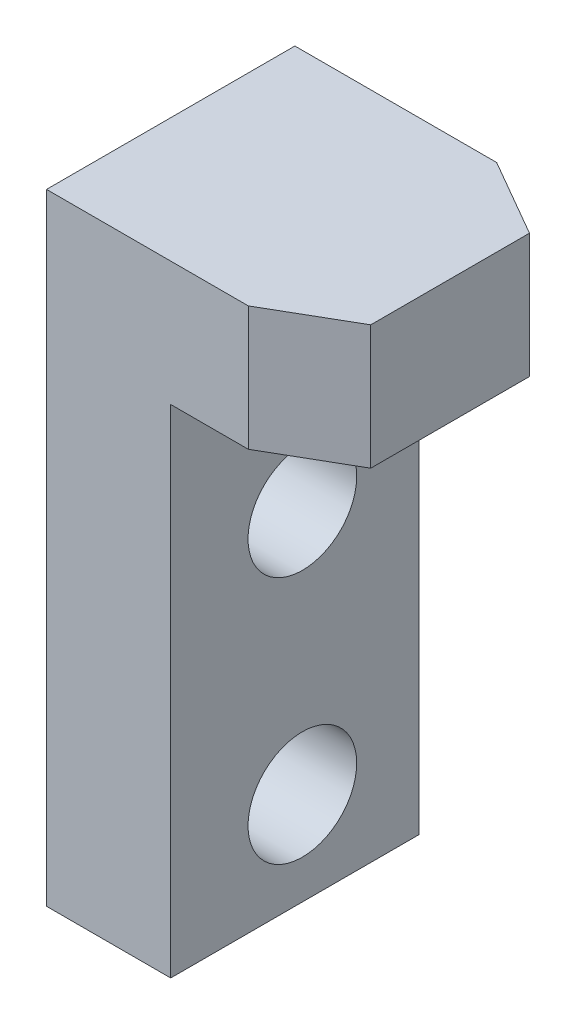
ISO-10303-21;
HEADER;
FILE_DESCRIPTION(('STEP AP214'),'2;1');
FILE_NAME('part.step','',(''),(''),'','','');
FILE_SCHEMA(('AUTOMOTIVE_DESIGN { 1 0 10303 214 1 1 1 1 }'));
ENDSEC;
DATA;
#1=APPLICATION_CONTEXT('core data for automotive mechanical design processes');
#2=APPLICATION_PROTOCOL_DEFINITION('international standard','automotive_design',2000,#1);
#3=PRODUCT_CONTEXT('',#1,'mechanical');
#4=PRODUCT('Part','Part','',(#3));
#5=PRODUCT_RELATED_PRODUCT_CATEGORY('part','',(#4));
#6=PRODUCT_DEFINITION_FORMATION('','',#4);
#7=PRODUCT_DEFINITION_CONTEXT('part definition',#1,'design');
#8=PRODUCT_DEFINITION('design','',#6,#7);
#9=PRODUCT_DEFINITION_SHAPE('','',#8);
#10=(LENGTH_UNIT() NAMED_UNIT(*) SI_UNIT(.MILLI.,.METRE.));
#11=(NAMED_UNIT(*) PLANE_ANGLE_UNIT() SI_UNIT($,.RADIAN.));
#12=(NAMED_UNIT(*) SI_UNIT($,.STERADIAN.) SOLID_ANGLE_UNIT());
#13=UNCERTAINTY_MEASURE_WITH_UNIT(LENGTH_MEASURE(1.E-05),#10,'distance_accuracy_value','');
#14=(GEOMETRIC_REPRESENTATION_CONTEXT(3) GLOBAL_UNCERTAINTY_ASSIGNED_CONTEXT((#13)) GLOBAL_UNIT_ASSIGNED_CONTEXT((#10,
#11,#12)) REPRESENTATION_CONTEXT('',''));
#15=CARTESIAN_POINT('',(0.,0.,0.));
#16=DIRECTION('',(0.,0.,1.));
#17=DIRECTION('',(1.,0.,0.));
#18=AXIS2_PLACEMENT_3D('',#15,#16,#17);
#19=CARTESIAN_POINT('',(0.,0.,8.));
#20=DIRECTION('',(1.,0.,0.));
#21=DIRECTION('',(0.,1.,0.));
#22=AXIS2_PLACEMENT_3D('',#19,#20,#21);
#23=PLANE('',#22);
#24=CARTESIAN_POINT('',(0.,-9.,3.75896126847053));
#25=DIRECTION('',(1.,0.,0.));
#26=DIRECTION('',(0.,0.,-1.));
#27=AXIS2_PLACEMENT_3D('',#24,#25,#26);
#28=CIRCLE('',#27,1.75);
#29=CARTESIAN_POINT('',(0.,-9.,2.00896126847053));
#30=VERTEX_POINT('',#29);
#31=EDGE_CURVE('E183',#30,#30,#28,.T.);
#32=ORIENTED_EDGE('',*,*,#31,.T.);
#33=EDGE_LOOP('',(#32));
#34=FACE_BOUND('',#33,.T.);
#35=CARTESIAN_POINT('',(0.,-17.,3.75896126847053));
#36=DIRECTION('',(1.,0.,0.));
#37=DIRECTION('',(0.,0.,-1.));
#38=AXIS2_PLACEMENT_3D('',#35,#36,#37);
#39=CIRCLE('',#38,1.75);
#40=CARTESIAN_POINT('',(0.,-17.,2.00896126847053));
#41=VERTEX_POINT('',#40);
#42=EDGE_CURVE('E177',#41,#41,#39,.T.);
#43=ORIENTED_EDGE('',*,*,#42,.T.);
#44=EDGE_LOOP('',(#43));
#45=FACE_BOUND('',#44,.T.);
#46=DIRECTION('',(0.,-1.,0.));
#47=VECTOR('',#46,1.);
#48=CARTESIAN_POINT('',(0.,0.,0.));
#49=LINE('',#48,#47);
#50=CARTESIAN_POINT('',(0.,0.,0.));
#51=VERTEX_POINT('',#50);
#52=CARTESIAN_POINT('',(0.,-20.,0.));
#53=VERTEX_POINT('',#52);
#54=EDGE_CURVE('E124',#51,#53,#49,.T.);
#55=ORIENTED_EDGE('',*,*,#54,.T.);
#56=DIRECTION('',(0.,0.,-1.));
#57=VECTOR('',#56,1.);
#58=CARTESIAN_POINT('',(0.,-20.,8.));
#59=LINE('',#58,#57);
#60=CARTESIAN_POINT('',(0.,-20.,8.));
#61=VERTEX_POINT('',#60);
#62=EDGE_CURVE('E103',#61,#53,#59,.T.);
#63=ORIENTED_EDGE('',*,*,#62,.F.);
#64=DIRECTION('',(0.,-1.,0.));
#65=VECTOR('',#64,1.);
#66=CARTESIAN_POINT('',(0.,0.,8.));
#67=LINE('',#66,#65);
#68=CARTESIAN_POINT('',(0.,0.,8.));
#69=VERTEX_POINT('',#68);
#70=EDGE_CURVE('E110',#69,#61,#67,.T.);
#71=ORIENTED_EDGE('',*,*,#70,.F.);
#72=DIRECTION('',(0.,0.,-1.));
#73=VECTOR('',#72,1.);
#74=CARTESIAN_POINT('',(0.,0.,8.));
#75=LINE('',#74,#73);
#76=EDGE_CURVE('E161',#69,#51,#75,.T.);
#77=ORIENTED_EDGE('',*,*,#76,.T.);
#78=EDGE_LOOP('',(#55,#63,#71,#77));
#79=FACE_BOUND('',#78,.T.);
#80=ADVANCED_FACE('F33',(#34,#45,#79),#23,.F.);
#81=CARTESIAN_POINT('',(0.,-20.,8.));
#82=DIRECTION('',(0.,1.,0.));
#83=DIRECTION('',(0.,0.,1.));
#84=AXIS2_PLACEMENT_3D('',#81,#82,#83);
#85=PLANE('',#84);
#86=DIRECTION('',(1.,0.,0.));
#87=VECTOR('',#86,1.);
#88=CARTESIAN_POINT('',(0.,-20.,0.));
#89=LINE('',#88,#87);
#90=CARTESIAN_POINT('',(4.,-20.,0.));
#91=VERTEX_POINT('',#90);
#92=EDGE_CURVE('E172',#53,#91,#89,.T.);
#93=ORIENTED_EDGE('',*,*,#92,.T.);
#94=DIRECTION('',(0.,0.,-1.));
#95=VECTOR('',#94,1.);
#96=CARTESIAN_POINT('',(4.,-20.,8.));
#97=LINE('',#96,#95);
#98=CARTESIAN_POINT('',(4.,-20.,8.));
#99=VERTEX_POINT('',#98);
#100=EDGE_CURVE('E106',#99,#91,#97,.T.);
#101=ORIENTED_EDGE('',*,*,#100,.F.);
#102=DIRECTION('',(1.,0.,0.));
#103=VECTOR('',#102,1.);
#104=CARTESIAN_POINT('',(0.,-20.,8.));
#105=LINE('',#104,#103);
#106=EDGE_CURVE('E99',#61,#99,#105,.T.);
#107=ORIENTED_EDGE('',*,*,#106,.F.);
#108=ORIENTED_EDGE('',*,*,#62,.T.);
#109=EDGE_LOOP('',(#93,#101,#107,#108));
#110=FACE_BOUND('',#109,.T.);
#111=ADVANCED_FACE('F101',(#110),#85,.F.);
#112=CARTESIAN_POINT('',(4.,-20.,8.));
#113=DIRECTION('',(-1.,0.,0.));
#114=DIRECTION('',(0.,0.,1.));
#115=AXIS2_PLACEMENT_3D('',#112,#113,#114);
#116=PLANE('',#115);
#117=CARTESIAN_POINT('',(4.,-9.,3.75896126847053));
#118=DIRECTION('',(1.,0.,0.));
#119=DIRECTION('',(0.,0.,-1.));
#120=AXIS2_PLACEMENT_3D('',#117,#118,#119);
#121=CIRCLE('',#120,1.75);
#122=CARTESIAN_POINT('',(4.,-9.,2.00896126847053));
#123=VERTEX_POINT('',#122);
#124=EDGE_CURVE('E186',#123,#123,#121,.T.);
#125=ORIENTED_EDGE('',*,*,#124,.F.);
#126=EDGE_LOOP('',(#125));
#127=FACE_BOUND('',#126,.T.);
#128=CARTESIAN_POINT('',(4.,-17.,3.75896126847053));
#129=DIRECTION('',(1.,0.,0.));
#130=DIRECTION('',(0.,0.,-1.));
#131=AXIS2_PLACEMENT_3D('',#128,#129,#130);
#132=CIRCLE('',#131,1.75);
#133=CARTESIAN_POINT('',(4.,-17.,2.00896126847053));
#134=VERTEX_POINT('',#133);
#135=EDGE_CURVE('E180',#134,#134,#132,.T.);
#136=ORIENTED_EDGE('',*,*,#135,.F.);
#137=EDGE_LOOP('',(#136));
#138=FACE_BOUND('',#137,.T.);
#139=DIRECTION('',(0.,1.,0.));
#140=VECTOR('',#139,1.);
#141=CARTESIAN_POINT('',(4.,-20.,0.));
#142=LINE('',#141,#140);
#143=CARTESIAN_POINT('',(4.,-4.,0.));
#144=VERTEX_POINT('',#143);
#145=EDGE_CURVE('E170',#91,#144,#142,.T.);
#146=ORIENTED_EDGE('',*,*,#145,.T.);
#147=DIRECTION('',(0.,0.,-1.));
#148=VECTOR('',#147,1.);
#149=CARTESIAN_POINT('',(4.,-4.,8.));
#150=LINE('',#149,#148);
#151=CARTESIAN_POINT('',(4.,-4.,8.));
#152=VERTEX_POINT('',#151);
#153=EDGE_CURVE('E129',#152,#144,#150,.T.);
#154=ORIENTED_EDGE('',*,*,#153,.F.);
#155=DIRECTION('',(0.,1.,0.));
#156=VECTOR('',#155,1.);
#157=CARTESIAN_POINT('',(4.,-20.,8.));
#158=LINE('',#157,#156);
#159=EDGE_CURVE('E109',#99,#152,#158,.T.);
#160=ORIENTED_EDGE('',*,*,#159,.F.);
#161=ORIENTED_EDGE('',*,*,#100,.T.);
#162=EDGE_LOOP('',(#146,#154,#160,#161));
#163=FACE_BOUND('',#162,.T.);
#164=ADVANCED_FACE('F201',(#127,#138,#163),#116,.F.);
#165=CARTESIAN_POINT('',(9.,-4.,8.));
#166=DIRECTION('',(0.,1.,0.));
#167=DIRECTION('',(-1.,0.,0.));
#168=AXIS2_PLACEMENT_3D('',#165,#166,#167);
#169=PLANE('',#168);
#170=DIRECTION('',(0.,0.,-1.));
#171=VECTOR('',#170,1.);
#172=CARTESIAN_POINT('',(9.,-4.,8.));
#173=LINE('',#172,#171);
#174=CARTESIAN_POINT('',(9.,-4.,6.55662432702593));
#175=VERTEX_POINT('',#174);
#176=CARTESIAN_POINT('',(9.,-4.,1.44337567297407));
#177=VERTEX_POINT('',#176);
#178=EDGE_CURVE('E146',#175,#177,#173,.T.);
#179=ORIENTED_EDGE('',*,*,#178,.F.);
#180=DIRECTION('',(-0.86602540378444,0.,0.499999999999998));
#181=VECTOR('',#180,1.);
#182=CARTESIAN_POINT('',(6.49999999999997,-4.,8.));
#183=LINE('',#182,#181);
#184=CARTESIAN_POINT('',(6.49999999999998,-4.,8.));
#185=VERTEX_POINT('',#184);
#186=EDGE_CURVE('E41',#175,#185,#183,.T.);
#187=ORIENTED_EDGE('',*,*,#186,.T.);
#188=DIRECTION('',(1.,0.,0.));
#189=VECTOR('',#188,1.);
#190=CARTESIAN_POINT('',(9.,-4.,8.));
#191=LINE('',#190,#189);
#192=EDGE_CURVE('E145',#152,#185,#191,.T.);
#193=ORIENTED_EDGE('',*,*,#192,.F.);
#194=ORIENTED_EDGE('',*,*,#153,.T.);
#195=DIRECTION('',(1.,0.,0.));
#196=VECTOR('',#195,1.);
#197=CARTESIAN_POINT('',(9.,-4.,0.));
#198=LINE('',#197,#196);
#199=CARTESIAN_POINT('',(6.49999999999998,-4.,0.));
#200=VERTEX_POINT('',#199);
#201=EDGE_CURVE('E166',#144,#200,#198,.T.);
#202=ORIENTED_EDGE('',*,*,#201,.T.);
#203=DIRECTION('',(-0.86602540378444,0.,-0.499999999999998));
#204=VECTOR('',#203,1.);
#205=CARTESIAN_POINT('',(9.,-4.,1.44337567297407));
#206=LINE('',#205,#204);
#207=EDGE_CURVE('E53',#200,#177,#206,.F.);
#208=ORIENTED_EDGE('',*,*,#207,.T.);
#209=EDGE_LOOP('',(#179,#187,#193,#194,#202,#208));
#210=FACE_BOUND('',#209,.T.);
#211=ADVANCED_FACE('F143',(#210),#169,.F.);
#212=CARTESIAN_POINT('',(9.,0.,8.));
#213=DIRECTION('',(-1.,0.,0.));
#214=DIRECTION('',(0.,0.,1.));
#215=AXIS2_PLACEMENT_3D('',#212,#213,#214);
#216=PLANE('',#215);
#217=DIRECTION('',(0.,0.,-1.));
#218=VECTOR('',#217,1.);
#219=CARTESIAN_POINT('',(9.,0.,8.));
#220=LINE('',#219,#218);
#221=CARTESIAN_POINT('',(9.,0.,6.55662432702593));
#222=VERTEX_POINT('',#221);
#223=CARTESIAN_POINT('',(9.,0.,1.44337567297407));
#224=VERTEX_POINT('',#223);
#225=EDGE_CURVE('E157',#222,#224,#220,.T.);
#226=ORIENTED_EDGE('',*,*,#225,.F.);
#227=DIRECTION('',(0.,-1.,0.));
#228=VECTOR('',#227,1.);
#229=CARTESIAN_POINT('',(9.,-4.,6.55662432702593));
#230=LINE('',#229,#228);
#231=EDGE_CURVE('E139',#222,#175,#230,.T.);
#232=ORIENTED_EDGE('',*,*,#231,.T.);
#233=ORIENTED_EDGE('',*,*,#178,.T.);
#234=DIRECTION('',(0.,1.,0.));
#235=VECTOR('',#234,1.);
#236=CARTESIAN_POINT('',(9.,0.,1.44337567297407));
#237=LINE('',#236,#235);
#238=EDGE_CURVE('E136',#177,#224,#237,.T.);
#239=ORIENTED_EDGE('',*,*,#238,.T.);
#240=EDGE_LOOP('',(#226,#232,#233,#239));
#241=FACE_BOUND('',#240,.T.);
#242=ADVANCED_FACE('F159',(#241),#216,.F.);
#243=CARTESIAN_POINT('',(0.,0.,8.));
#244=DIRECTION('',(0.,-1.,0.));
#245=DIRECTION('',(0.,0.,-1.));
#246=AXIS2_PLACEMENT_3D('',#243,#244,#245);
#247=PLANE('',#246);
#248=DIRECTION('',(-1.,0.,0.));
#249=VECTOR('',#248,1.);
#250=CARTESIAN_POINT('',(0.,0.,8.));
#251=LINE('',#250,#249);
#252=CARTESIAN_POINT('',(6.49999999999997,0.,8.));
#253=VERTEX_POINT('',#252);
#254=EDGE_CURVE('E117',#253,#69,#251,.T.);
#255=ORIENTED_EDGE('',*,*,#254,.F.);
#256=DIRECTION('',(0.86602540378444,0.,-0.499999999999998));
#257=VECTOR('',#256,1.);
#258=CARTESIAN_POINT('',(6.49999999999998,0.,8.));
#259=LINE('',#258,#257);
#260=EDGE_CURVE('E134',#253,#222,#259,.T.);
#261=ORIENTED_EDGE('',*,*,#260,.T.);
#262=ORIENTED_EDGE('',*,*,#225,.T.);
#263=DIRECTION('',(0.86602540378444,0.,0.499999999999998));
#264=VECTOR('',#263,1.);
#265=CARTESIAN_POINT('',(9.,0.,1.44337567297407));
#266=LINE('',#265,#264);
#267=CARTESIAN_POINT('',(6.49999999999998,0.,0.));
#268=VERTEX_POINT('',#267);
#269=EDGE_CURVE('E127',#224,#268,#266,.F.);
#270=ORIENTED_EDGE('',*,*,#269,.T.);
#271=DIRECTION('',(-1.,0.,0.));
#272=VECTOR('',#271,1.);
#273=CARTESIAN_POINT('',(0.,0.,0.));
#274=LINE('',#273,#272);
#275=EDGE_CURVE('E121',#268,#51,#274,.T.);
#276=ORIENTED_EDGE('',*,*,#275,.T.);
#277=ORIENTED_EDGE('',*,*,#76,.F.);
#278=EDGE_LOOP('',(#255,#261,#262,#270,#276,#277));
#279=FACE_BOUND('',#278,.T.);
#280=ADVANCED_FACE('F156',(#279),#247,.F.);
#281=CARTESIAN_POINT('',(0.,-20.,8.));
#282=DIRECTION('',(0.,0.,1.));
#283=DIRECTION('',(1.,0.,0.));
#284=AXIS2_PLACEMENT_3D('',#281,#282,#283);
#285=PLANE('',#284);
#286=ORIENTED_EDGE('',*,*,#192,.T.);
#287=DIRECTION('',(0.,1.,0.));
#288=VECTOR('',#287,1.);
#289=CARTESIAN_POINT('',(6.49999999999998,0.,8.));
#290=LINE('',#289,#288);
#291=EDGE_CURVE('E125',#185,#253,#290,.T.);
#292=ORIENTED_EDGE('',*,*,#291,.T.);
#293=ORIENTED_EDGE('',*,*,#254,.T.);
#294=ORIENTED_EDGE('',*,*,#70,.T.);
#295=ORIENTED_EDGE('',*,*,#106,.T.);
#296=ORIENTED_EDGE('',*,*,#159,.T.);
#297=EDGE_LOOP('',(#286,#292,#293,#294,#295,#296));
#298=FACE_BOUND('',#297,.T.);
#299=ADVANCED_FACE('F114',(#298),#285,.T.);
#300=CARTESIAN_POINT('',(0.,-20.,0.));
#301=DIRECTION('',(0.,0.,1.));
#302=DIRECTION('',(1.,0.,0.));
#303=AXIS2_PLACEMENT_3D('',#300,#301,#302);
#304=PLANE('',#303);
#305=ORIENTED_EDGE('',*,*,#275,.F.);
#306=DIRECTION('',(0.,-1.,0.));
#307=VECTOR('',#306,1.);
#308=CARTESIAN_POINT('',(6.49999999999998,-20.,0.));
#309=LINE('',#308,#307);
#310=EDGE_CURVE('E11',#268,#200,#309,.T.);
#311=ORIENTED_EDGE('',*,*,#310,.T.);
#312=ORIENTED_EDGE('',*,*,#201,.F.);
#313=ORIENTED_EDGE('',*,*,#145,.F.);
#314=ORIENTED_EDGE('',*,*,#92,.F.);
#315=ORIENTED_EDGE('',*,*,#54,.F.);
#316=EDGE_LOOP('',(#305,#311,#312,#313,#314,#315));
#317=FACE_BOUND('',#316,.T.);
#318=ADVANCED_FACE('F169',(#317),#304,.F.);
#319=CARTESIAN_POINT('',(6.49999999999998,-20.,8.));
#320=DIRECTION('',(0.499999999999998,0.,0.86602540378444));
#321=DIRECTION('',(0.86602540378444,0.,-0.499999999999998));
#322=AXIS2_PLACEMENT_3D('',#319,#320,#321);
#323=PLANE('',#322);
#324=ORIENTED_EDGE('',*,*,#186,.F.);
#325=ORIENTED_EDGE('',*,*,#231,.F.);
#326=ORIENTED_EDGE('',*,*,#260,.F.);
#327=ORIENTED_EDGE('',*,*,#291,.F.);
#328=EDGE_LOOP('',(#324,#325,#326,#327));
#329=FACE_BOUND('',#328,.T.);
#330=ADVANCED_FACE('F152',(#329),#323,.T.);
#331=CARTESIAN_POINT('',(9.,0.,1.44337567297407));
#332=DIRECTION('',(-0.499999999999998,0.,0.86602540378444));
#333=DIRECTION('',(0.86602540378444,0.,0.499999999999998));
#334=AXIS2_PLACEMENT_3D('',#331,#332,#333);
#335=PLANE('',#334);
#336=ORIENTED_EDGE('',*,*,#207,.F.);
#337=ORIENTED_EDGE('',*,*,#310,.F.);
#338=ORIENTED_EDGE('',*,*,#269,.F.);
#339=ORIENTED_EDGE('',*,*,#238,.F.);
#340=EDGE_LOOP('',(#336,#337,#338,#339));
#341=FACE_BOUND('',#340,.T.);
#342=ADVANCED_FACE('F35',(#341),#335,.F.);
#343=CARTESIAN_POINT('',(0.,-17.,3.75896126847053));
#344=DIRECTION('',(1.,0.,0.));
#345=DIRECTION('',(0.,0.,-1.));
#346=AXIS2_PLACEMENT_3D('',#343,#344,#345);
#347=CYLINDRICAL_SURFACE('',#346,1.75);
#348=ORIENTED_EDGE('',*,*,#42,.F.);
#349=EDGE_LOOP('',(#348));
#350=FACE_BOUND('',#349,.T.);
#351=ORIENTED_EDGE('',*,*,#135,.T.);
#352=EDGE_LOOP('',(#351));
#353=FACE_BOUND('',#352,.T.);
#354=ADVANCED_FACE('F197',(#350,#353),#347,.F.);
#355=CARTESIAN_POINT('',(0.,-9.,3.75896126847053));
#356=DIRECTION('',(1.,0.,0.));
#357=DIRECTION('',(0.,0.,-1.));
#358=AXIS2_PLACEMENT_3D('',#355,#356,#357);
#359=CYLINDRICAL_SURFACE('',#358,1.75);
#360=ORIENTED_EDGE('',*,*,#31,.F.);
#361=EDGE_LOOP('',(#360));
#362=FACE_BOUND('',#361,.T.);
#363=ORIENTED_EDGE('',*,*,#124,.T.);
#364=EDGE_LOOP('',(#363));
#365=FACE_BOUND('',#364,.T.);
#366=ADVANCED_FACE('F194',(#362,#365),#359,.F.);
#367=CLOSED_SHELL('',(#80,#111,#164,#211,#242,#280,#299,#318,#330,#342,#354,#366));
#368=MANIFOLD_SOLID_BREP('B2',#367);
#369=ADVANCED_BREP_SHAPE_REPRESENTATION('',(#18,#368),#14);
#370=SHAPE_DEFINITION_REPRESENTATION(#9,#369);
ENDSEC;
END-ISO-10303-21;
